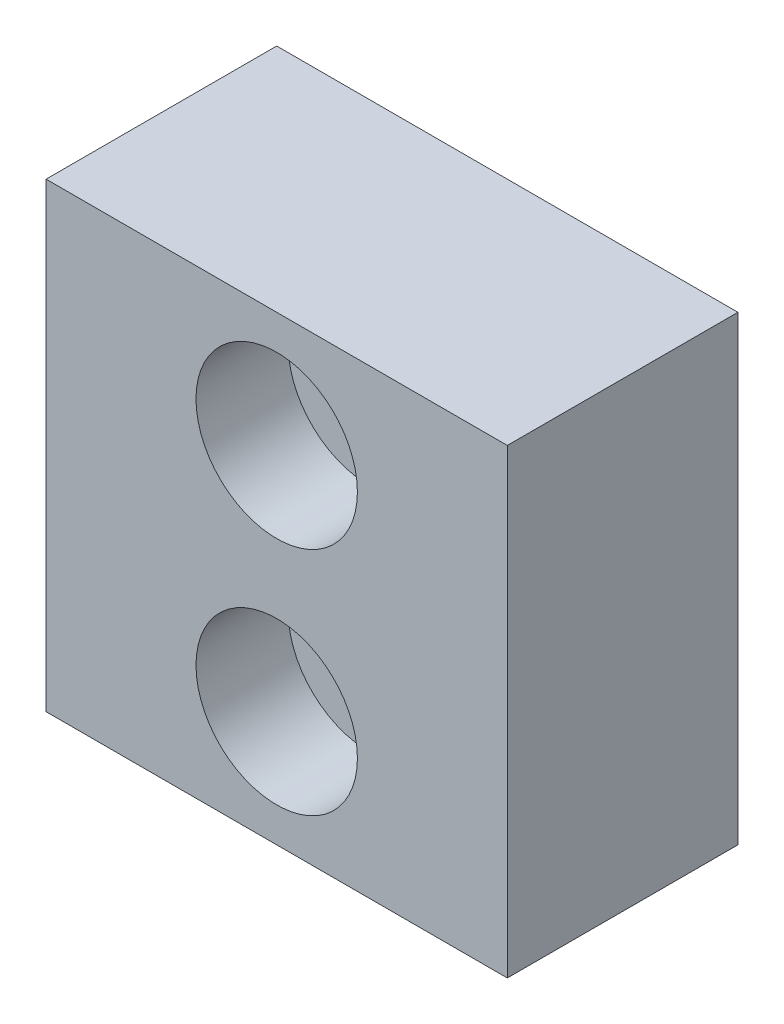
from build123d import *

# Parameters (mm, degrees)
SKETCH1_W           = 20
SKETCH1_H           = 20
BOSS_EXTRUDE1_DEPTH = 5
SKETCH2_R           = 2
CUT_EXTRUDE1_DEPTH  = 10
SKETCH3_R           = 3.5
CUT_EXTRUDE2_DEPTH  = 4


with BuildPart() as part:
    # Sketch1 → Boss-Extrude1 (new, symmetric)
    with BuildSketch(Plane.XY):
        Rectangle(SKETCH1_W, SKETCH1_H)
    extrude(amount=BOSS_EXTRUDE1_DEPTH, both=True)

    # Sketch2 → Cut-Extrude1 (cut)
    with BuildSketch(Plane.XY.offset(5)):
        with Locations((0, 5)):
            Circle(SKETCH2_R)
        with Locations((0, -5)):
            Circle(SKETCH2_R)
    extrude(amount=-CUT_EXTRUDE1_DEPTH, mode=Mode.SUBTRACT)

    # Sketch3 → Cut-Extrude2 (cut)
    with BuildSketch(Plane.XY.offset(5)):
        with Locations((0, 5)):
            Circle(SKETCH3_R)
        with Locations((0, -5)):
            Circle(SKETCH3_R)
    extrude(amount=-CUT_EXTRUDE2_DEPTH, mode=Mode.SUBTRACT)


solid = part.part
